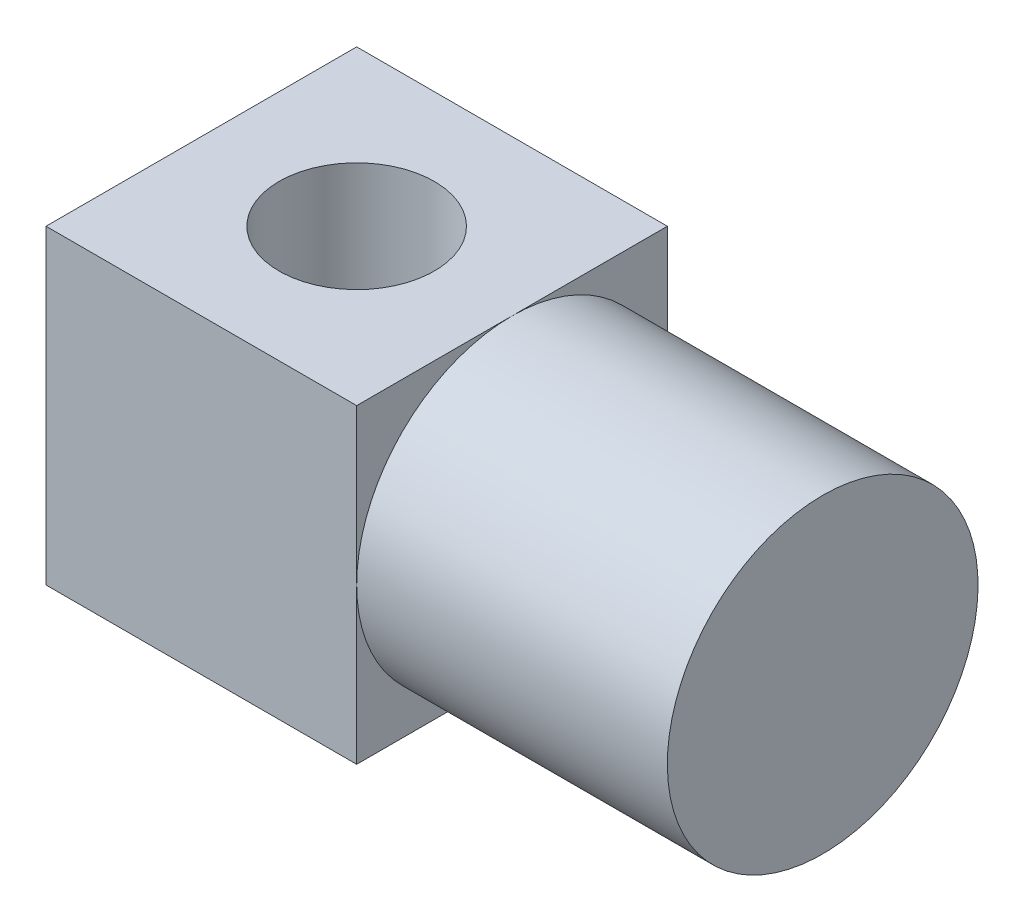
from build123d import *

# Parameters (mm, degrees)
BOSS_EXTRU_1_DEPTH      = 5
BOSS_EXTRU_1_DEPTH_BACK = 5
ESQUISSE1_W             = 10
ESQUISSE1_H             = 10
ESQUISSE2_R             = 5
BOSS_EXTRU_2_DEPTH      = 10
ESQUISSE3_R             = 2.5
ENL_V_MAT_EXTRU_1_DEPTH = 10


with BuildPart() as part:
    # Esquisse1 → Boss.-Extru.1 (new, two sides: drawn at the far end of the back side and taken through both)
    with BuildSketch(Plane.XY.offset(-BOSS_EXTRU_1_DEPTH_BACK)):
        Rectangle(ESQUISSE1_W, ESQUISSE1_H)
    extrude(amount=BOSS_EXTRU_1_DEPTH + BOSS_EXTRU_1_DEPTH_BACK)

    # Esquisse2 → Boss.-Extru.2 (add)
    with BuildSketch(Plane(origin=(5, 0, 0), x_dir=(0, 0, -1), z_dir=(1, 0, 0))):
        with Locations(Location((0, 0, 0), (0, 0, 90))):
            Circle(ESQUISSE2_R)
    extrude(amount=BOSS_EXTRU_2_DEPTH)

    # Esquisse3 → Enl_v. mat.-Extru.1 (cut)
    with BuildSketch(Plane(origin=(0, 5, 0), x_dir=(1, 0, 0), z_dir=(0, 1, 0))):
        with Locations(Location((0, 0, 0), (0, 0, 180))):
            Circle(ESQUISSE3_R)
    extrude(amount=-ENL_V_MAT_EXTRU_1_DEPTH, mode=Mode.SUBTRACT)


solid = part.part
